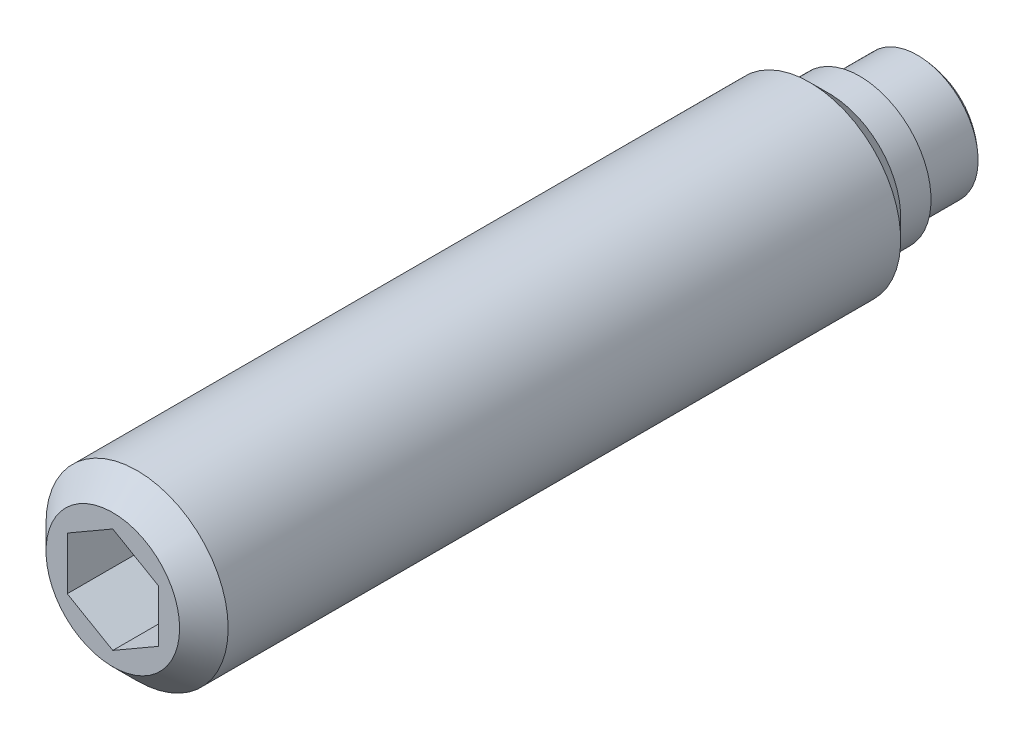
ISO-10303-21;
HEADER;
FILE_DESCRIPTION(('STEP AP214'),'2;1');
FILE_NAME('part.step','',(''),(''),'','','');
FILE_SCHEMA(('AUTOMOTIVE_DESIGN { 1 0 10303 214 1 1 1 1 }'));
ENDSEC;
DATA;
#1=APPLICATION_CONTEXT('core data for automotive mechanical design processes');
#2=APPLICATION_PROTOCOL_DEFINITION('international standard','automotive_design',2000,#1);
#3=PRODUCT_CONTEXT('',#1,'mechanical');
#4=PRODUCT('Part','Part','',(#3));
#5=PRODUCT_RELATED_PRODUCT_CATEGORY('part','',(#4));
#6=PRODUCT_DEFINITION_FORMATION('','',#4);
#7=PRODUCT_DEFINITION_CONTEXT('part definition',#1,'design');
#8=PRODUCT_DEFINITION('design','',#6,#7);
#9=PRODUCT_DEFINITION_SHAPE('','',#8);
#10=(LENGTH_UNIT() NAMED_UNIT(*) SI_UNIT(.MILLI.,.METRE.));
#11=(NAMED_UNIT(*) PLANE_ANGLE_UNIT() SI_UNIT($,.RADIAN.));
#12=(NAMED_UNIT(*) SI_UNIT($,.STERADIAN.) SOLID_ANGLE_UNIT());
#13=UNCERTAINTY_MEASURE_WITH_UNIT(LENGTH_MEASURE(1.E-05),#10,'distance_accuracy_value','');
#14=(GEOMETRIC_REPRESENTATION_CONTEXT(3) GLOBAL_UNCERTAINTY_ASSIGNED_CONTEXT((#13)) GLOBAL_UNIT_ASSIGNED_CONTEXT((#10,
#11,#12)) REPRESENTATION_CONTEXT('',''));
#15=CARTESIAN_POINT('',(0.,0.,0.));
#16=DIRECTION('',(0.,0.,1.));
#17=DIRECTION('',(1.,0.,0.));
#18=AXIS2_PLACEMENT_3D('',#15,#16,#17);
#19=CARTESIAN_POINT('',(0.,2.35,2.7));
#20=DIRECTION('',(0.,0.,1.));
#21=DIRECTION('',(1.,0.,0.));
#22=AXIS2_PLACEMENT_3D('',#19,#20,#21);
#23=PLANE('',#22);
#24=CARTESIAN_POINT('',(0.,0.,2.7));
#25=DIRECTION('',(0.,0.,-1.));
#26=DIRECTION('',(-1.,0.,0.));
#27=AXIS2_PLACEMENT_3D('',#24,#25,#26);
#28=CIRCLE('',#27,2.);
#29=CARTESIAN_POINT('',(-2.00000000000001,0.,2.7));
#30=VERTEX_POINT('',#29);
#31=EDGE_CURVE('E124',#30,#30,#28,.T.);
#32=ORIENTED_EDGE('',*,*,#31,.F.);
#33=EDGE_LOOP('',(#32));
#34=FACE_BOUND('',#33,.T.);
#35=CARTESIAN_POINT('',(0.,0.,2.7));
#36=DIRECTION('',(0.,0.,-1.));
#37=DIRECTION('',(-1.,0.,0.));
#38=AXIS2_PLACEMENT_3D('',#35,#36,#37);
#39=CIRCLE('',#38,2.35);
#40=CARTESIAN_POINT('',(-2.35000000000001,0.,2.7));
#41=VERTEX_POINT('',#40);
#42=EDGE_CURVE('E127',#41,#41,#39,.T.);
#43=ORIENTED_EDGE('',*,*,#42,.T.);
#44=EDGE_LOOP('',(#43));
#45=FACE_BOUND('',#44,.T.);
#46=ADVANCED_FACE('F14',(#34,#45),#23,.F.);
#47=CARTESIAN_POINT('',(0.,0.,2.7));
#48=DIRECTION('',(0.,0.,-1.));
#49=DIRECTION('',(-1.,0.,0.));
#50=AXIS2_PLACEMENT_3D('',#47,#48,#49);
#51=CYLINDRICAL_SURFACE('',#50,3.);
#52=CARTESIAN_POINT('',(0.,0.,26.5));
#53=DIRECTION('',(0.,0.,1.));
#54=DIRECTION('',(1.,0.,0.));
#55=AXIS2_PLACEMENT_3D('',#52,#53,#54);
#56=CIRCLE('',#55,3.);
#57=CARTESIAN_POINT('',(2.99999999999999,0.,26.5));
#58=VERTEX_POINT('',#57);
#59=EDGE_CURVE('E9',#58,#58,#56,.F.);
#60=ORIENTED_EDGE('',*,*,#59,.T.);
#61=EDGE_LOOP('',(#60));
#62=FACE_BOUND('',#61,.T.);
#63=CARTESIAN_POINT('',(0.,0.,4.35));
#64=DIRECTION('',(0.,0.,-1.));
#65=DIRECTION('',(-1.,0.,0.));
#66=AXIS2_PLACEMENT_3D('',#63,#64,#65);
#67=CIRCLE('',#66,3.);
#68=CARTESIAN_POINT('',(-3.00000000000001,0.,4.35));
#69=VERTEX_POINT('',#68);
#70=EDGE_CURVE('E133',#69,#69,#67,.T.);
#71=ORIENTED_EDGE('',*,*,#70,.F.);
#72=EDGE_LOOP('',(#71));
#73=FACE_BOUND('',#72,.T.);
#74=ADVANCED_FACE('F151',(#62,#73),#51,.T.);
#75=CARTESIAN_POINT('',(0.,0.,4.35));
#76=DIRECTION('',(0.,0.,1.));
#77=DIRECTION('',(1.,0.,0.));
#78=AXIS2_PLACEMENT_3D('',#75,#76,#77);
#79=CONICAL_SURFACE('',#78,3.,0.785398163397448);
#80=CARTESIAN_POINT('',(0.,0.,3.7));
#81=DIRECTION('',(0.,0.,-1.));
#82=DIRECTION('',(-1.,0.,0.));
#83=AXIS2_PLACEMENT_3D('',#80,#81,#82);
#84=CIRCLE('',#83,2.35);
#85=CARTESIAN_POINT('',(-2.35000000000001,0.,3.7));
#86=VERTEX_POINT('',#85);
#87=EDGE_CURVE('E130',#86,#86,#84,.T.);
#88=ORIENTED_EDGE('',*,*,#87,.F.);
#89=EDGE_LOOP('',(#88));
#90=FACE_BOUND('',#89,.T.);
#91=ORIENTED_EDGE('',*,*,#70,.T.);
#92=EDGE_LOOP('',(#91));
#93=FACE_BOUND('',#92,.T.);
#94=ADVANCED_FACE('F158',(#90,#93),#79,.T.);
#95=CARTESIAN_POINT('',(0.,0.,2.7));
#96=DIRECTION('',(0.,0.,-1.));
#97=DIRECTION('',(-1.,0.,0.));
#98=AXIS2_PLACEMENT_3D('',#95,#96,#97);
#99=CYLINDRICAL_SURFACE('',#98,2.35);
#100=ORIENTED_EDGE('',*,*,#42,.F.);
#101=EDGE_LOOP('',(#100));
#102=FACE_BOUND('',#101,.T.);
#103=ORIENTED_EDGE('',*,*,#87,.T.);
#104=EDGE_LOOP('',(#103));
#105=FACE_BOUND('',#104,.T.);
#106=ADVANCED_FACE('F166',(#102,#105),#99,.T.);
#107=CARTESIAN_POINT('',(0.,0.,0.));
#108=DIRECTION('',(0.,0.,-1.));
#109=DIRECTION('',(-1.,0.,0.));
#110=AXIS2_PLACEMENT_3D('',#107,#108,#109);
#111=CYLINDRICAL_SURFACE('',#110,2.);
#112=CARTESIAN_POINT('',(0.,0.,0.8));
#113=DIRECTION('',(0.,0.,-1.));
#114=DIRECTION('',(-1.,0.,0.));
#115=AXIS2_PLACEMENT_3D('',#112,#113,#114);
#116=CIRCLE('',#115,2.);
#117=CARTESIAN_POINT('',(-2.00000000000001,0.,0.8));
#118=VERTEX_POINT('',#117);
#119=EDGE_CURVE('E114',#118,#118,#116,.T.);
#120=ORIENTED_EDGE('',*,*,#119,.F.);
#121=EDGE_LOOP('',(#120));
#122=FACE_BOUND('',#121,.T.);
#123=ORIENTED_EDGE('',*,*,#31,.T.);
#124=EDGE_LOOP('',(#123));
#125=FACE_BOUND('',#124,.T.);
#126=ADVANCED_FACE('F164',(#122,#125),#111,.T.);
#127=CARTESIAN_POINT('',(0.0398938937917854,0.,2.9997347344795));
#128=DIRECTION('',(0.,-1.,0.));
#129=DIRECTION('',(-1.,0.,0.));
#130=AXIS2_PLACEMENT_3D('',#127,#128,#129);
#131=CIRCLE('',#130,3.00000000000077);
#132=TRIMMED_CURVE('',#131,(PARAMETER_VALUE(-1.55749797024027)),
(PARAMETER_VALUE(1.55749797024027)),.T.,.PARAMETER.);
#133=CARTESIAN_POINT('',(0.,0.,2.9997347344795));
#134=DIRECTION('',(0.,0.,-1.));
#135=AXIS1_PLACEMENT('',#133,#134);
#136=SURFACE_OF_REVOLUTION('',#132,#135);
#137=ORIENTED_EDGE('',*,*,#119,.T.);
#138=EDGE_LOOP('',(#137));
#139=FACE_BOUND('',#138,.T.);
#140=CARTESIAN_POINT('',(0.,0.,0.));
#141=VERTEX_POINT('',#140);
#142=VERTEX_LOOP('',#141);
#143=FACE_BOUND('',#142,.T.);
#144=ADVANCED_FACE('F198',(#139,#143),#136,.T.);
#145=CARTESIAN_POINT('',(0.,0.,27.3));
#146=DIRECTION('',(0.,0.,1.));
#147=DIRECTION('',(1.,0.,0.));
#148=AXIS2_PLACEMENT_3D('',#145,#146,#147);
#149=PLANE('',#148);
#150=CARTESIAN_POINT('',(0.,0.,27.3));
#151=DIRECTION('',(0.,0.,1.));
#152=DIRECTION('',(1.,0.,0.));
#153=AXIS2_PLACEMENT_3D('',#150,#151,#152);
#154=CIRCLE('',#153,2.2);
#155=CARTESIAN_POINT('',(2.19999999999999,0.,27.3));
#156=VERTEX_POINT('',#155);
#157=EDGE_CURVE('E22',#156,#156,#154,.T.);
#158=ORIENTED_EDGE('',*,*,#157,.T.);
#159=EDGE_LOOP('',(#158));
#160=FACE_BOUND('',#159,.T.);
#161=DIRECTION('',(-0.866025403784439,0.5,0.));
#162=VECTOR('',#161,1.);
#163=CARTESIAN_POINT('',(1.5,0.866025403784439,27.3));
#164=LINE('',#163,#162);
#165=CARTESIAN_POINT('',(1.5,0.866025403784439,27.3));
#166=VERTEX_POINT('',#165);
#167=CARTESIAN_POINT('',(0.,1.73205080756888,27.3));
#168=VERTEX_POINT('',#167);
#169=EDGE_CURVE('E29',#166,#168,#164,.T.);
#170=ORIENTED_EDGE('',*,*,#169,.F.);
#171=DIRECTION('',(0.,1.,0.));
#172=VECTOR('',#171,1.);
#173=CARTESIAN_POINT('',(1.5,-0.866025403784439,27.3));
#174=LINE('',#173,#172);
#175=CARTESIAN_POINT('',(1.5,-0.866025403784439,27.3));
#176=VERTEX_POINT('',#175);
#177=EDGE_CURVE('E88',#176,#166,#174,.T.);
#178=ORIENTED_EDGE('',*,*,#177,.F.);
#179=DIRECTION('',(0.866025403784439,0.5,0.));
#180=VECTOR('',#179,1.);
#181=CARTESIAN_POINT('',(0.,-1.73205080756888,27.3));
#182=LINE('',#181,#180);
#183=CARTESIAN_POINT('',(0.,-1.73205080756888,27.3));
#184=VERTEX_POINT('',#183);
#185=EDGE_CURVE('E91',#184,#176,#182,.T.);
#186=ORIENTED_EDGE('',*,*,#185,.F.);
#187=DIRECTION('',(0.866025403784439,-0.5,0.));
#188=VECTOR('',#187,1.);
#189=CARTESIAN_POINT('',(-1.5,-0.866025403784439,27.3));
#190=LINE('',#189,#188);
#191=CARTESIAN_POINT('',(-1.5,-0.866025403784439,27.3));
#192=VERTEX_POINT('',#191);
#193=EDGE_CURVE('E107',#192,#184,#190,.T.);
#194=ORIENTED_EDGE('',*,*,#193,.F.);
#195=DIRECTION('',(0.,-1.,0.));
#196=VECTOR('',#195,1.);
#197=CARTESIAN_POINT('',(-1.5,0.866025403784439,27.3));
#198=LINE('',#197,#196);
#199=CARTESIAN_POINT('',(-1.5,0.866025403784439,27.3));
#200=VERTEX_POINT('',#199);
#201=EDGE_CURVE('E104',#200,#192,#198,.T.);
#202=ORIENTED_EDGE('',*,*,#201,.F.);
#203=DIRECTION('',(-0.866025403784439,-0.5,0.));
#204=VECTOR('',#203,1.);
#205=CARTESIAN_POINT('',(0.,1.73205080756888,27.3));
#206=LINE('',#205,#204);
#207=EDGE_CURVE('E102',#168,#200,#206,.T.);
#208=ORIENTED_EDGE('',*,*,#207,.F.);
#209=EDGE_LOOP('',(#170,#178,#186,#194,#202,#208));
#210=FACE_BOUND('',#209,.T.);
#211=ADVANCED_FACE('F138',(#160,#210),#149,.T.);
#212=CARTESIAN_POINT('',(1.5,0.866025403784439,23.8));
#213=DIRECTION('',(0.5,0.866025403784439,0.));
#214=DIRECTION('',(-0.866025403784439,0.5,0.));
#215=AXIS2_PLACEMENT_3D('',#212,#213,#214);
#216=PLANE('',#215);
#217=ORIENTED_EDGE('',*,*,#169,.T.);
#218=DIRECTION('',(0.,0.,1.));
#219=VECTOR('',#218,1.);
#220=CARTESIAN_POINT('',(0.,1.73205080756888,23.8));
#221=LINE('',#220,#219);
#222=CARTESIAN_POINT('',(0.,1.73205080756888,23.8));
#223=VERTEX_POINT('',#222);
#224=EDGE_CURVE('E65',#223,#168,#221,.T.);
#225=ORIENTED_EDGE('',*,*,#224,.F.);
#226=DIRECTION('',(-0.866025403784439,0.5,0.));
#227=VECTOR('',#226,1.);
#228=CARTESIAN_POINT('',(1.5,0.866025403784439,23.8));
#229=LINE('',#228,#227);
#230=CARTESIAN_POINT('',(1.5,0.866025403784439,23.8));
#231=VERTEX_POINT('',#230);
#232=EDGE_CURVE('E69',#231,#223,#229,.T.);
#233=ORIENTED_EDGE('',*,*,#232,.F.);
#234=DIRECTION('',(0.,0.,1.));
#235=VECTOR('',#234,1.);
#236=CARTESIAN_POINT('',(1.5,0.866025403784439,23.8));
#237=LINE('',#236,#235);
#238=EDGE_CURVE('E112',#231,#166,#237,.T.);
#239=ORIENTED_EDGE('',*,*,#238,.T.);
#240=EDGE_LOOP('',(#217,#225,#233,#239));
#241=FACE_BOUND('',#240,.T.);
#242=ADVANCED_FACE('F67',(#241),#216,.F.);
#243=CARTESIAN_POINT('',(1.5,-0.866025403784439,23.8));
#244=DIRECTION('',(1.,0.,0.));
#245=DIRECTION('',(0.,0.,-1.));
#246=AXIS2_PLACEMENT_3D('',#243,#244,#245);
#247=PLANE('',#246);
#248=ORIENTED_EDGE('',*,*,#177,.T.);
#249=ORIENTED_EDGE('',*,*,#238,.F.);
#250=DIRECTION('',(0.,1.,0.));
#251=VECTOR('',#250,1.);
#252=CARTESIAN_POINT('',(1.5,-0.866025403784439,23.8));
#253=LINE('',#252,#251);
#254=CARTESIAN_POINT('',(1.5,-0.866025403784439,23.8));
#255=VERTEX_POINT('',#254);
#256=EDGE_CURVE('E75',#255,#231,#253,.T.);
#257=ORIENTED_EDGE('',*,*,#256,.F.);
#258=DIRECTION('',(0.,0.,1.));
#259=VECTOR('',#258,1.);
#260=CARTESIAN_POINT('',(1.5,-0.866025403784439,23.8));
#261=LINE('',#260,#259);
#262=EDGE_CURVE('E115',#255,#176,#261,.T.);
#263=ORIENTED_EDGE('',*,*,#262,.T.);
#264=EDGE_LOOP('',(#248,#249,#257,#263));
#265=FACE_BOUND('',#264,.T.);
#266=ADVANCED_FACE('F220',(#265),#247,.F.);
#267=CARTESIAN_POINT('',(0.,-1.73205080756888,23.8));
#268=DIRECTION('',(0.5,-0.866025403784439,0.));
#269=DIRECTION('',(0.866025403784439,0.5,0.));
#270=AXIS2_PLACEMENT_3D('',#267,#268,#269);
#271=PLANE('',#270);
#272=ORIENTED_EDGE('',*,*,#185,.T.);
#273=ORIENTED_EDGE('',*,*,#262,.F.);
#274=DIRECTION('',(0.866025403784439,0.5,0.));
#275=VECTOR('',#274,1.);
#276=CARTESIAN_POINT('',(0.,-1.73205080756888,23.8));
#277=LINE('',#276,#275);
#278=CARTESIAN_POINT('',(0.,-1.73205080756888,23.8));
#279=VERTEX_POINT('',#278);
#280=EDGE_CURVE('E98',#279,#255,#277,.T.);
#281=ORIENTED_EDGE('',*,*,#280,.F.);
#282=DIRECTION('',(0.,0.,1.));
#283=VECTOR('',#282,1.);
#284=CARTESIAN_POINT('',(0.,-1.73205080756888,23.8));
#285=LINE('',#284,#283);
#286=EDGE_CURVE('E117',#279,#184,#285,.T.);
#287=ORIENTED_EDGE('',*,*,#286,.T.);
#288=EDGE_LOOP('',(#272,#273,#281,#287));
#289=FACE_BOUND('',#288,.T.);
#290=ADVANCED_FACE('F228',(#289),#271,.F.);
#291=CARTESIAN_POINT('',(-1.5,-0.866025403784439,23.8));
#292=DIRECTION('',(-0.5,-0.866025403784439,0.));
#293=DIRECTION('',(0.866025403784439,-0.5,0.));
#294=AXIS2_PLACEMENT_3D('',#291,#292,#293);
#295=PLANE('',#294);
#296=ORIENTED_EDGE('',*,*,#193,.T.);
#297=ORIENTED_EDGE('',*,*,#286,.F.);
#298=DIRECTION('',(0.866025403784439,-0.5,0.));
#299=VECTOR('',#298,1.);
#300=CARTESIAN_POINT('',(-1.5,-0.866025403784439,23.8));
#301=LINE('',#300,#299);
#302=CARTESIAN_POINT('',(-1.5,-0.866025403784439,23.8));
#303=VERTEX_POINT('',#302);
#304=EDGE_CURVE('E95',#303,#279,#301,.T.);
#305=ORIENTED_EDGE('',*,*,#304,.F.);
#306=DIRECTION('',(0.,0.,1.));
#307=VECTOR('',#306,1.);
#308=CARTESIAN_POINT('',(-1.5,-0.866025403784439,23.8));
#309=LINE('',#308,#307);
#310=EDGE_CURVE('E119',#303,#192,#309,.T.);
#311=ORIENTED_EDGE('',*,*,#310,.T.);
#312=EDGE_LOOP('',(#296,#297,#305,#311));
#313=FACE_BOUND('',#312,.T.);
#314=ADVANCED_FACE('F237',(#313),#295,.F.);
#315=CARTESIAN_POINT('',(-1.5,0.866025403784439,23.8));
#316=DIRECTION('',(-1.,0.,0.));
#317=DIRECTION('',(0.,-1.,0.));
#318=AXIS2_PLACEMENT_3D('',#315,#316,#317);
#319=PLANE('',#318);
#320=ORIENTED_EDGE('',*,*,#201,.T.);
#321=ORIENTED_EDGE('',*,*,#310,.F.);
#322=DIRECTION('',(0.,-1.,0.));
#323=VECTOR('',#322,1.);
#324=CARTESIAN_POINT('',(-1.5,0.866025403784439,23.8));
#325=LINE('',#324,#323);
#326=CARTESIAN_POINT('',(-1.5,0.866025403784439,23.8));
#327=VERTEX_POINT('',#326);
#328=EDGE_CURVE('E83',#327,#303,#325,.T.);
#329=ORIENTED_EDGE('',*,*,#328,.F.);
#330=DIRECTION('',(0.,0.,1.));
#331=VECTOR('',#330,1.);
#332=CARTESIAN_POINT('',(-1.5,0.866025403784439,23.8));
#333=LINE('',#332,#331);
#334=EDGE_CURVE('E74',#327,#200,#333,.T.);
#335=ORIENTED_EDGE('',*,*,#334,.T.);
#336=EDGE_LOOP('',(#320,#321,#329,#335));
#337=FACE_BOUND('',#336,.T.);
#338=ADVANCED_FACE('F246',(#337),#319,.F.);
#339=CARTESIAN_POINT('',(0.,1.73205080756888,23.8));
#340=DIRECTION('',(-0.5,0.866025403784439,0.));
#341=DIRECTION('',(-0.866025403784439,-0.5,0.));
#342=AXIS2_PLACEMENT_3D('',#339,#340,#341);
#343=PLANE('',#342);
#344=ORIENTED_EDGE('',*,*,#207,.T.);
#345=ORIENTED_EDGE('',*,*,#334,.F.);
#346=DIRECTION('',(-0.866025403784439,-0.5,0.));
#347=VECTOR('',#346,1.);
#348=CARTESIAN_POINT('',(0.,1.73205080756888,23.8));
#349=LINE('',#348,#347);
#350=EDGE_CURVE('E78',#223,#327,#349,.T.);
#351=ORIENTED_EDGE('',*,*,#350,.F.);
#352=ORIENTED_EDGE('',*,*,#224,.T.);
#353=EDGE_LOOP('',(#344,#345,#351,#352));
#354=FACE_BOUND('',#353,.T.);
#355=ADVANCED_FACE('F79',(#354),#343,.F.);
#356=CARTESIAN_POINT('',(0.,0.,23.8));
#357=DIRECTION('',(0.,0.,1.));
#358=DIRECTION('',(1.,0.,0.));
#359=AXIS2_PLACEMENT_3D('',#356,#357,#358);
#360=PLANE('',#359);
#361=ORIENTED_EDGE('',*,*,#232,.T.);
#362=ORIENTED_EDGE('',*,*,#350,.T.);
#363=ORIENTED_EDGE('',*,*,#328,.T.);
#364=ORIENTED_EDGE('',*,*,#304,.T.);
#365=ORIENTED_EDGE('',*,*,#280,.T.);
#366=ORIENTED_EDGE('',*,*,#256,.T.);
#367=EDGE_LOOP('',(#361,#362,#363,#364,#365,#366));
#368=FACE_BOUND('',#367,.T.);
#369=ADVANCED_FACE('F85',(#368),#360,.T.);
#370=CARTESIAN_POINT('',(0.,0.,27.3));
#371=DIRECTION('',(0.,0.,-1.));
#372=DIRECTION('',(-1.,0.,0.));
#373=AXIS2_PLACEMENT_3D('',#370,#371,#372);
#374=CONICAL_SURFACE('',#373,2.2,0.785398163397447);
#375=ORIENTED_EDGE('',*,*,#59,.F.);
#376=EDGE_LOOP('',(#375));
#377=FACE_BOUND('',#376,.T.);
#378=ORIENTED_EDGE('',*,*,#157,.F.);
#379=EDGE_LOOP('',(#378));
#380=FACE_BOUND('',#379,.T.);
#381=ADVANCED_FACE('F16',(#377,#380),#374,.T.);
#382=CLOSED_SHELL('',(#46,#74,#94,#106,#126,#144,#211,#242,#266,#290,#314,#338,#355,#369,#381));
#383=MANIFOLD_SOLID_BREP('B1',#382);
#384=ADVANCED_BREP_SHAPE_REPRESENTATION('',(#18,#383),#14);
#385=SHAPE_DEFINITION_REPRESENTATION(#9,#384);
ENDSEC;
END-ISO-10303-21;
